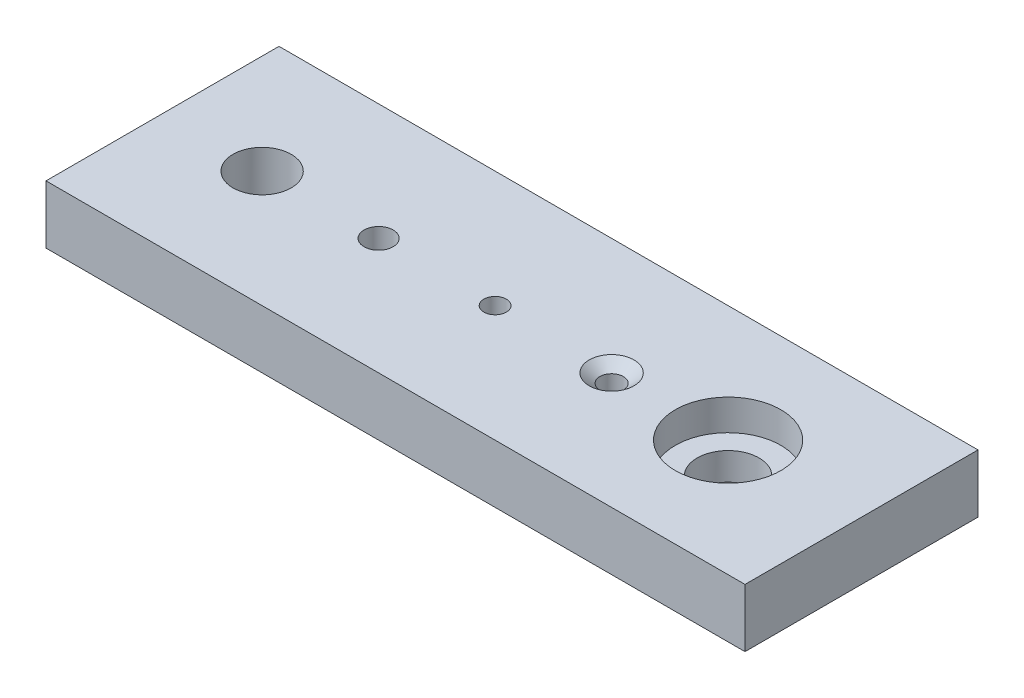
ISO-10303-21;
HEADER;
FILE_DESCRIPTION(('STEP AP214'),'2;1');
FILE_NAME('part.step','',(''),(''),'','','');
FILE_SCHEMA(('AUTOMOTIVE_DESIGN { 1 0 10303 214 1 1 1 1 }'));
ENDSEC;
DATA;
#1=APPLICATION_CONTEXT('core data for automotive mechanical design processes');
#2=APPLICATION_PROTOCOL_DEFINITION('international standard','automotive_design',2000,#1);
#3=PRODUCT_CONTEXT('',#1,'mechanical');
#4=PRODUCT('Part','Part','',(#3));
#5=PRODUCT_RELATED_PRODUCT_CATEGORY('part','',(#4));
#6=PRODUCT_DEFINITION_FORMATION('','',#4);
#7=PRODUCT_DEFINITION_CONTEXT('part definition',#1,'design');
#8=PRODUCT_DEFINITION('design','',#6,#7);
#9=PRODUCT_DEFINITION_SHAPE('','',#8);
#10=(LENGTH_UNIT() NAMED_UNIT(*) SI_UNIT(.MILLI.,.METRE.));
#11=(NAMED_UNIT(*) PLANE_ANGLE_UNIT() SI_UNIT($,.RADIAN.));
#12=(NAMED_UNIT(*) SI_UNIT($,.STERADIAN.) SOLID_ANGLE_UNIT());
#13=UNCERTAINTY_MEASURE_WITH_UNIT(LENGTH_MEASURE(1.E-05),#10,'distance_accuracy_value','');
#14=(GEOMETRIC_REPRESENTATION_CONTEXT(3) GLOBAL_UNCERTAINTY_ASSIGNED_CONTEXT((#13)) GLOBAL_UNIT_ASSIGNED_CONTEXT((#10,
#11,#12)) REPRESENTATION_CONTEXT('',''));
#15=CARTESIAN_POINT('',(0.,0.,0.));
#16=DIRECTION('',(0.,0.,1.));
#17=DIRECTION('',(1.,0.,0.));
#18=AXIS2_PLACEMENT_3D('',#15,#16,#17);
#19=CARTESIAN_POINT('',(0.,12.7,0.));
#20=DIRECTION('',(1.,0.,0.));
#21=DIRECTION('',(0.,0.,-1.));
#22=AXIS2_PLACEMENT_3D('',#19,#20,#21);
#23=PLANE('',#22);
#24=DIRECTION('',(0.,0.,1.));
#25=VECTOR('',#24,1.);
#26=CARTESIAN_POINT('',(0.,0.,0.));
#27=LINE('',#26,#25);
#28=CARTESIAN_POINT('',(0.,0.,-50.8));
#29=VERTEX_POINT('',#28);
#30=CARTESIAN_POINT('',(0.,0.,0.));
#31=VERTEX_POINT('',#30);
#32=EDGE_CURVE('E96',#29,#31,#27,.T.);
#33=ORIENTED_EDGE('',*,*,#32,.T.);
#34=DIRECTION('',(0.,-1.,0.));
#35=VECTOR('',#34,1.);
#36=CARTESIAN_POINT('',(0.,12.7,0.));
#37=LINE('',#36,#35);
#38=CARTESIAN_POINT('',(0.,12.7,0.));
#39=VERTEX_POINT('',#38);
#40=EDGE_CURVE('E11',#39,#31,#37,.T.);
#41=ORIENTED_EDGE('',*,*,#40,.F.);
#42=DIRECTION('',(0.,0.,1.));
#43=VECTOR('',#42,1.);
#44=CARTESIAN_POINT('',(0.,12.7,0.));
#45=LINE('',#44,#43);
#46=CARTESIAN_POINT('',(0.,12.7,-50.8));
#47=VERTEX_POINT('',#46);
#48=EDGE_CURVE('E84',#47,#39,#45,.T.);
#49=ORIENTED_EDGE('',*,*,#48,.F.);
#50=DIRECTION('',(0.,-1.,0.));
#51=VECTOR('',#50,1.);
#52=CARTESIAN_POINT('',(0.,12.7,-50.8));
#53=LINE('',#52,#51);
#54=EDGE_CURVE('E92',#47,#29,#53,.T.);
#55=ORIENTED_EDGE('',*,*,#54,.T.);
#56=EDGE_LOOP('',(#33,#41,#49,#55));
#57=FACE_BOUND('',#56,.T.);
#58=ADVANCED_FACE('F33',(#57),#23,.F.);
#59=CARTESIAN_POINT('',(0.,12.7,0.));
#60=DIRECTION('',(0.,0.,-1.));
#61=DIRECTION('',(-1.,0.,0.));
#62=AXIS2_PLACEMENT_3D('',#59,#60,#61);
#63=PLANE('',#62);
#64=DIRECTION('',(1.,0.,0.));
#65=VECTOR('',#64,1.);
#66=CARTESIAN_POINT('',(0.,0.,0.));
#67=LINE('',#66,#65);
#68=CARTESIAN_POINT('',(152.4,0.,0.));
#69=VERTEX_POINT('',#68);
#70=EDGE_CURVE('E88',#31,#69,#67,.T.);
#71=ORIENTED_EDGE('',*,*,#70,.T.);
#72=DIRECTION('',(0.,-1.,0.));
#73=VECTOR('',#72,1.);
#74=CARTESIAN_POINT('',(152.4,12.7,0.));
#75=LINE('',#74,#73);
#76=CARTESIAN_POINT('',(152.4,12.7,0.));
#77=VERTEX_POINT('',#76);
#78=EDGE_CURVE('E41',#77,#69,#75,.T.);
#79=ORIENTED_EDGE('',*,*,#78,.F.);
#80=DIRECTION('',(1.,0.,0.));
#81=VECTOR('',#80,1.);
#82=CARTESIAN_POINT('',(0.,12.7,0.));
#83=LINE('',#82,#81);
#84=EDGE_CURVE('E79',#39,#77,#83,.T.);
#85=ORIENTED_EDGE('',*,*,#84,.F.);
#86=ORIENTED_EDGE('',*,*,#40,.T.);
#87=EDGE_LOOP('',(#71,#79,#85,#86));
#88=FACE_BOUND('',#87,.T.);
#89=ADVANCED_FACE('F87',(#88),#63,.F.);
#90=CARTESIAN_POINT('',(152.4,12.7,0.));
#91=DIRECTION('',(-1.,0.,0.));
#92=DIRECTION('',(0.,0.,1.));
#93=AXIS2_PLACEMENT_3D('',#90,#91,#92);
#94=PLANE('',#93);
#95=DIRECTION('',(0.,0.,-1.));
#96=VECTOR('',#95,1.);
#97=CARTESIAN_POINT('',(152.4,0.,0.));
#98=LINE('',#97,#96);
#99=CARTESIAN_POINT('',(152.4,0.,-50.8));
#100=VERTEX_POINT('',#99);
#101=EDGE_CURVE('E66',#69,#100,#98,.T.);
#102=ORIENTED_EDGE('',*,*,#101,.T.);
#103=DIRECTION('',(0.,-1.,0.));
#104=VECTOR('',#103,1.);
#105=CARTESIAN_POINT('',(152.4,12.7,-50.8));
#106=LINE('',#105,#104);
#107=CARTESIAN_POINT('',(152.4,12.7,-50.8));
#108=VERTEX_POINT('',#107);
#109=EDGE_CURVE('E89',#108,#100,#106,.T.);
#110=ORIENTED_EDGE('',*,*,#109,.F.);
#111=DIRECTION('',(0.,0.,-1.));
#112=VECTOR('',#111,1.);
#113=CARTESIAN_POINT('',(152.4,12.7,0.));
#114=LINE('',#113,#112);
#115=EDGE_CURVE('E82',#77,#108,#114,.T.);
#116=ORIENTED_EDGE('',*,*,#115,.F.);
#117=ORIENTED_EDGE('',*,*,#78,.T.);
#118=EDGE_LOOP('',(#102,#110,#116,#117));
#119=FACE_BOUND('',#118,.T.);
#120=ADVANCED_FACE('F90',(#119),#94,.F.);
#121=CARTESIAN_POINT('',(0.,12.7,-50.8));
#122=DIRECTION('',(0.,0.,1.));
#123=DIRECTION('',(1.,0.,0.));
#124=AXIS2_PLACEMENT_3D('',#121,#122,#123);
#125=PLANE('',#124);
#126=DIRECTION('',(-1.,0.,0.));
#127=VECTOR('',#126,1.);
#128=CARTESIAN_POINT('',(0.,0.,-50.8));
#129=LINE('',#128,#127);
#130=EDGE_CURVE('E72',#100,#29,#129,.T.);
#131=ORIENTED_EDGE('',*,*,#130,.T.);
#132=ORIENTED_EDGE('',*,*,#54,.F.);
#133=DIRECTION('',(-1.,0.,0.));
#134=VECTOR('',#133,1.);
#135=CARTESIAN_POINT('',(0.,12.7,-50.8));
#136=LINE('',#135,#134);
#137=EDGE_CURVE('E49',#108,#47,#136,.T.);
#138=ORIENTED_EDGE('',*,*,#137,.F.);
#139=ORIENTED_EDGE('',*,*,#109,.T.);
#140=EDGE_LOOP('',(#131,#132,#138,#139));
#141=FACE_BOUND('',#140,.T.);
#142=ADVANCED_FACE('F104',(#141),#125,.F.);
#143=CARTESIAN_POINT('',(0.,12.7,0.));
#144=DIRECTION('',(0.,-1.,0.));
#145=DIRECTION('',(0.,0.,-1.));
#146=AXIS2_PLACEMENT_3D('',#143,#144,#145);
#147=PLANE('',#146);
#148=CARTESIAN_POINT('',(123.317,12.7,-25.4));
#149=DIRECTION('',(0.,1.,0.));
#150=DIRECTION('',(0.,0.,1.));
#151=AXIS2_PLACEMENT_3D('',#148,#149,#150);
#152=CIRCLE('',#151,11.50747);
#153=CARTESIAN_POINT('',(123.317,12.7,-13.89253));
#154=VERTEX_POINT('',#153);
#155=EDGE_CURVE('E145',#154,#154,#152,.T.);
#156=ORIENTED_EDGE('',*,*,#155,.F.);
#157=EDGE_LOOP('',(#156));
#158=FACE_BOUND('',#157,.T.);
#159=CARTESIAN_POINT('',(97.917,12.7,-25.4));
#160=DIRECTION('',(0.,1.,0.));
#161=DIRECTION('',(0.,0.,1.));
#162=AXIS2_PLACEMENT_3D('',#159,#160,#161);
#163=CIRCLE('',#162,4.88950000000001);
#164=CARTESIAN_POINT('',(97.917,12.7,-20.5105));
#165=VERTEX_POINT('',#164);
#166=EDGE_CURVE('E133',#165,#165,#163,.T.);
#167=ORIENTED_EDGE('',*,*,#166,.F.);
#168=EDGE_LOOP('',(#167));
#169=FACE_BOUND('',#168,.T.);
#170=CARTESIAN_POINT('',(72.517,12.7,-25.4));
#171=DIRECTION('',(0.,1.,0.));
#172=DIRECTION('',(0.,0.,1.));
#173=AXIS2_PLACEMENT_3D('',#170,#171,#172);
#174=CIRCLE('',#173,2.45744999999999);
#175=CARTESIAN_POINT('',(72.517,12.7,-22.94255));
#176=VERTEX_POINT('',#175);
#177=EDGE_CURVE('E124',#176,#176,#174,.T.);
#178=ORIENTED_EDGE('',*,*,#177,.F.);
#179=EDGE_LOOP('',(#178));
#180=FACE_BOUND('',#179,.T.);
#181=CARTESIAN_POINT('',(47.117,12.7,-25.4));
#182=DIRECTION('',(0.,1.,0.));
#183=DIRECTION('',(0.,0.,1.));
#184=AXIS2_PLACEMENT_3D('',#181,#182,#183);
#185=CIRCLE('',#184,3.175);
#186=CARTESIAN_POINT('',(47.117,12.7,-22.225));
#187=VERTEX_POINT('',#186);
#188=EDGE_CURVE('E118',#187,#187,#185,.T.);
#189=ORIENTED_EDGE('',*,*,#188,.F.);
#190=EDGE_LOOP('',(#189));
#191=FACE_BOUND('',#190,.T.);
#192=CARTESIAN_POINT('',(21.717,12.7,-25.4));
#193=DIRECTION('',(0.,1.,0.));
#194=DIRECTION('',(0.,0.,1.));
#195=AXIS2_PLACEMENT_3D('',#192,#193,#194);
#196=CIRCLE('',#195,6.34999999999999);
#197=CARTESIAN_POINT('',(21.717,12.7,-19.05));
#198=VERTEX_POINT('',#197);
#199=EDGE_CURVE('E112',#198,#198,#196,.T.);
#200=ORIENTED_EDGE('',*,*,#199,.F.);
#201=EDGE_LOOP('',(#200));
#202=FACE_BOUND('',#201,.T.);
#203=ORIENTED_EDGE('',*,*,#48,.T.);
#204=ORIENTED_EDGE('',*,*,#84,.T.);
#205=ORIENTED_EDGE('',*,*,#115,.T.);
#206=ORIENTED_EDGE('',*,*,#137,.T.);
#207=EDGE_LOOP('',(#203,#204,#205,#206));
#208=FACE_BOUND('',#207,.T.);
#209=ADVANCED_FACE('F80',(#158,#169,#180,#191,#202,#208),#147,.F.);
#210=CARTESIAN_POINT('',(0.,0.,0.));
#211=DIRECTION('',(0.,-1.,0.));
#212=DIRECTION('',(0.,0.,-1.));
#213=AXIS2_PLACEMENT_3D('',#210,#211,#212);
#214=PLANE('',#213);
#215=CARTESIAN_POINT('',(123.317,0.,-25.4));
#216=DIRECTION('',(0.,-1.,0.));
#217=DIRECTION('',(0.,0.,-1.));
#218=AXIS2_PLACEMENT_3D('',#215,#216,#217);
#219=CIRCLE('',#218,6.74624);
#220=CARTESIAN_POINT('',(123.317,0.,-32.14624));
#221=VERTEX_POINT('',#220);
#222=EDGE_CURVE('E136',#221,#221,#219,.T.);
#223=ORIENTED_EDGE('',*,*,#222,.F.);
#224=EDGE_LOOP('',(#223));
#225=FACE_BOUND('',#224,.T.);
#226=CARTESIAN_POINT('',(97.917,0.,-25.4));
#227=DIRECTION('',(0.,1.,0.));
#228=DIRECTION('',(0.,0.,1.));
#229=AXIS2_PLACEMENT_3D('',#226,#227,#228);
#230=CIRCLE('',#229,2.55269999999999);
#231=CARTESIAN_POINT('',(97.917,0.,-22.8473));
#232=VERTEX_POINT('',#231);
#233=EDGE_CURVE('E127',#232,#232,#230,.T.);
#234=ORIENTED_EDGE('',*,*,#233,.T.);
#235=EDGE_LOOP('',(#234));
#236=FACE_BOUND('',#235,.T.);
#237=CARTESIAN_POINT('',(72.517,0.,-25.4));
#238=DIRECTION('',(0.,-1.,0.));
#239=DIRECTION('',(0.,0.,-1.));
#240=AXIS2_PLACEMENT_3D('',#237,#238,#239);
#241=CIRCLE('',#240,2.45744999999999);
#242=CARTESIAN_POINT('',(72.517,0.,-27.85745));
#243=VERTEX_POINT('',#242);
#244=EDGE_CURVE('E121',#243,#243,#241,.T.);
#245=ORIENTED_EDGE('',*,*,#244,.F.);
#246=EDGE_LOOP('',(#245));
#247=FACE_BOUND('',#246,.T.);
#248=CARTESIAN_POINT('',(47.117,0.,-25.4));
#249=DIRECTION('',(0.,-1.,0.));
#250=DIRECTION('',(0.,0.,-1.));
#251=AXIS2_PLACEMENT_3D('',#248,#249,#250);
#252=CIRCLE('',#251,3.17499999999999);
#253=CARTESIAN_POINT('',(47.117,0.,-28.575));
#254=VERTEX_POINT('',#253);
#255=EDGE_CURVE('E115',#254,#254,#252,.T.);
#256=ORIENTED_EDGE('',*,*,#255,.F.);
#257=EDGE_LOOP('',(#256));
#258=FACE_BOUND('',#257,.T.);
#259=CARTESIAN_POINT('',(21.717,0.,-25.4));
#260=DIRECTION('',(0.,-1.,0.));
#261=DIRECTION('',(0.,0.,-1.));
#262=AXIS2_PLACEMENT_3D('',#259,#260,#261);
#263=CIRCLE('',#262,6.34999999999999);
#264=CARTESIAN_POINT('',(21.717,0.,-31.75));
#265=VERTEX_POINT('',#264);
#266=EDGE_CURVE('E99',#265,#265,#263,.T.);
#267=ORIENTED_EDGE('',*,*,#266,.F.);
#268=EDGE_LOOP('',(#267));
#269=FACE_BOUND('',#268,.T.);
#270=ORIENTED_EDGE('',*,*,#32,.F.);
#271=ORIENTED_EDGE('',*,*,#130,.F.);
#272=ORIENTED_EDGE('',*,*,#101,.F.);
#273=ORIENTED_EDGE('',*,*,#70,.F.);
#274=EDGE_LOOP('',(#270,#271,#272,#273));
#275=FACE_BOUND('',#274,.T.);
#276=ADVANCED_FACE('F107',(#225,#236,#247,#258,#269,#275),#214,.T.);
#277=CARTESIAN_POINT('',(21.717,12.7,-25.4));
#278=DIRECTION('',(0.,1.,0.));
#279=DIRECTION('',(0.,0.,1.));
#280=AXIS2_PLACEMENT_3D('',#277,#278,#279);
#281=CYLINDRICAL_SURFACE('',#280,6.34999999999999);
#282=ORIENTED_EDGE('',*,*,#199,.T.);
#283=EDGE_LOOP('',(#282));
#284=FACE_BOUND('',#283,.T.);
#285=ORIENTED_EDGE('',*,*,#266,.T.);
#286=EDGE_LOOP('',(#285));
#287=FACE_BOUND('',#286,.T.);
#288=ADVANCED_FACE('F162',(#284,#287),#281,.F.);
#289=CARTESIAN_POINT('',(47.117,12.7,-25.4));
#290=DIRECTION('',(0.,1.,0.));
#291=DIRECTION('',(0.,0.,1.));
#292=AXIS2_PLACEMENT_3D('',#289,#290,#291);
#293=CYLINDRICAL_SURFACE('',#292,3.17499999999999);
#294=ORIENTED_EDGE('',*,*,#255,.T.);
#295=EDGE_LOOP('',(#294));
#296=FACE_BOUND('',#295,.T.);
#297=ORIENTED_EDGE('',*,*,#188,.T.);
#298=EDGE_LOOP('',(#297));
#299=FACE_BOUND('',#298,.T.);
#300=ADVANCED_FACE('F165',(#296,#299),#293,.F.);
#301=CARTESIAN_POINT('',(72.517,12.7,-25.4));
#302=DIRECTION('',(0.,1.,0.));
#303=DIRECTION('',(0.,0.,1.));
#304=AXIS2_PLACEMENT_3D('',#301,#302,#303);
#305=CYLINDRICAL_SURFACE('',#304,2.45744999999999);
#306=ORIENTED_EDGE('',*,*,#177,.T.);
#307=EDGE_LOOP('',(#306));
#308=FACE_BOUND('',#307,.T.);
#309=ORIENTED_EDGE('',*,*,#244,.T.);
#310=EDGE_LOOP('',(#309));
#311=FACE_BOUND('',#310,.T.);
#312=ADVANCED_FACE('F246',(#308,#311),#305,.F.);
#313=CARTESIAN_POINT('',(97.917,12.7,-25.4));
#314=DIRECTION('',(0.,1.,0.));
#315=DIRECTION('',(0.,0.,1.));
#316=AXIS2_PLACEMENT_3D('',#313,#314,#315);
#317=CYLINDRICAL_SURFACE('',#316,2.55269999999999);
#318=ORIENTED_EDGE('',*,*,#233,.F.);
#319=EDGE_LOOP('',(#318));
#320=FACE_BOUND('',#319,.T.);
#321=CARTESIAN_POINT('',(97.917,10.7391919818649,-25.4));
#322=DIRECTION('',(0.,1.,0.));
#323=DIRECTION('',(0.,0.,1.));
#324=AXIS2_PLACEMENT_3D('',#321,#322,#323);
#325=CIRCLE('',#324,2.55269999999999);
#326=CARTESIAN_POINT('',(97.917,10.7391919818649,-22.8473));
#327=VERTEX_POINT('',#326);
#328=EDGE_CURVE('E130',#327,#327,#325,.T.);
#329=ORIENTED_EDGE('',*,*,#328,.T.);
#330=EDGE_LOOP('',(#329));
#331=FACE_BOUND('',#330,.T.);
#332=ADVANCED_FACE('F242',(#320,#331),#317,.F.);
#333=CARTESIAN_POINT('',(97.917,12.7,-25.4));
#334=DIRECTION('',(0.,1.,0.));
#335=DIRECTION('',(0.,0.,1.));
#336=AXIS2_PLACEMENT_3D('',#333,#334,#335);
#337=CONICAL_SURFACE('',#336,4.88950000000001,0.872664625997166);
#338=ORIENTED_EDGE('',*,*,#328,.F.);
#339=EDGE_LOOP('',(#338));
#340=FACE_BOUND('',#339,.T.);
#341=ORIENTED_EDGE('',*,*,#166,.T.);
#342=EDGE_LOOP('',(#341));
#343=FACE_BOUND('',#342,.T.);
#344=ADVANCED_FACE('F201',(#340,#343),#337,.F.);
#345=CARTESIAN_POINT('',(123.317,12.7,-25.4));
#346=DIRECTION('',(0.,1.,0.));
#347=DIRECTION('',(0.,0.,1.));
#348=AXIS2_PLACEMENT_3D('',#345,#346,#347);
#349=CYLINDRICAL_SURFACE('',#348,6.74624);
#350=CARTESIAN_POINT('',(123.317,5.969,-25.4));
#351=DIRECTION('',(0.,1.,0.));
#352=DIRECTION('',(0.,0.,1.));
#353=AXIS2_PLACEMENT_3D('',#350,#351,#352);
#354=CIRCLE('',#353,6.74624000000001);
#355=CARTESIAN_POINT('',(123.317,5.969,-18.65376));
#356=VERTEX_POINT('',#355);
#357=EDGE_CURVE('E139',#356,#356,#354,.T.);
#358=ORIENTED_EDGE('',*,*,#357,.T.);
#359=EDGE_LOOP('',(#358));
#360=FACE_BOUND('',#359,.T.);
#361=ORIENTED_EDGE('',*,*,#222,.T.);
#362=EDGE_LOOP('',(#361));
#363=FACE_BOUND('',#362,.T.);
#364=ADVANCED_FACE('F211',(#360,#363),#349,.F.);
#365=CARTESIAN_POINT('',(130.06324,5.969,-25.4));
#366=DIRECTION('',(0.,-1.,0.));
#367=DIRECTION('',(0.,0.,-1.));
#368=AXIS2_PLACEMENT_3D('',#365,#366,#367);
#369=PLANE('',#368);
#370=ORIENTED_EDGE('',*,*,#357,.F.);
#371=EDGE_LOOP('',(#370));
#372=FACE_BOUND('',#371,.T.);
#373=CARTESIAN_POINT('',(123.317,5.969,-25.4));
#374=DIRECTION('',(0.,1.,0.));
#375=DIRECTION('',(0.,0.,1.));
#376=AXIS2_PLACEMENT_3D('',#373,#374,#375);
#377=CIRCLE('',#376,11.50747);
#378=CARTESIAN_POINT('',(123.317,5.969,-13.89253));
#379=VERTEX_POINT('',#378);
#380=EDGE_CURVE('E142',#379,#379,#377,.T.);
#381=ORIENTED_EDGE('',*,*,#380,.T.);
#382=EDGE_LOOP('',(#381));
#383=FACE_BOUND('',#382,.T.);
#384=ADVANCED_FACE('F216',(#372,#383),#369,.F.);
#385=CARTESIAN_POINT('',(123.317,12.7,-25.4));
#386=DIRECTION('',(0.,1.,0.));
#387=DIRECTION('',(0.,0.,1.));
#388=AXIS2_PLACEMENT_3D('',#385,#386,#387);
#389=CYLINDRICAL_SURFACE('',#388,11.50747);
#390=ORIENTED_EDGE('',*,*,#380,.F.);
#391=EDGE_LOOP('',(#390));
#392=FACE_BOUND('',#391,.T.);
#393=ORIENTED_EDGE('',*,*,#155,.T.);
#394=EDGE_LOOP('',(#393));
#395=FACE_BOUND('',#394,.T.);
#396=ADVANCED_FACE('F149',(#392,#395),#389,.F.);
#397=CLOSED_SHELL('',(#58,#89,#120,#142,#209,#276,#288,#300,#312,#332,#344,#364,#384,#396));
#398=MANIFOLD_SOLID_BREP('B2',#397);
#399=ADVANCED_BREP_SHAPE_REPRESENTATION('',(#18,#398),#14);
#400=SHAPE_DEFINITION_REPRESENTATION(#9,#399);
ENDSEC;
END-ISO-10303-21;
